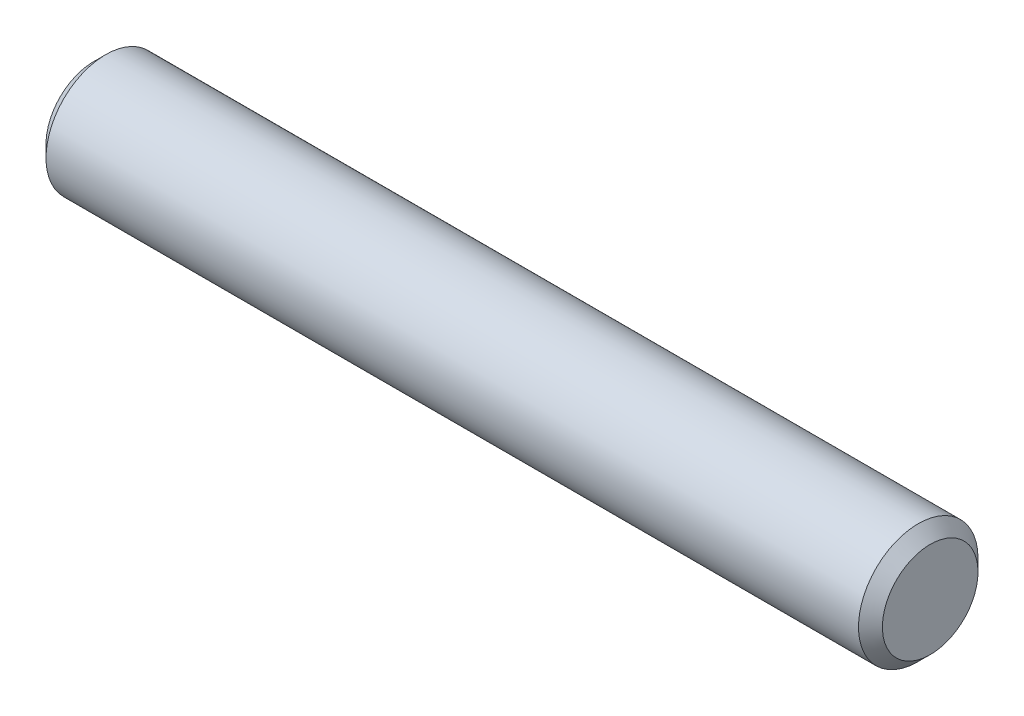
from build123d import *

# Parameters (mm, degrees)
EXTRUDE1_DEPTH      = 5.55625
EXTRUDE1_DEPTH_BACK = 5.55625
SKETCH2_R           = 0.79375
CHAMFER1_SIZE       = 0.15875


with BuildPart() as part:
    # Sketch2 → Extrude1 (new, two sides: drawn at the far end of the back side and taken through both)
    with BuildSketch(Plane(origin=(0, 0, 0), x_dir=(0, 0, -1), z_dir=(1, 0, 0)).offset(-EXTRUDE1_DEPTH_BACK)):
        Circle(SKETCH2_R)
    extrude(amount=EXTRUDE1_DEPTH + EXTRUDE1_DEPTH_BACK)

    # Chamfer1
    chamfer1_edges = [part.edges().sort_by_distance(p)[0] for p in [
        (-5.55625, 0, 0.79375),
        (5.55625, 0, 0.79375),
    ]]
    chamfer(chamfer1_edges, length=CHAMFER1_SIZE)


solid = part.part
